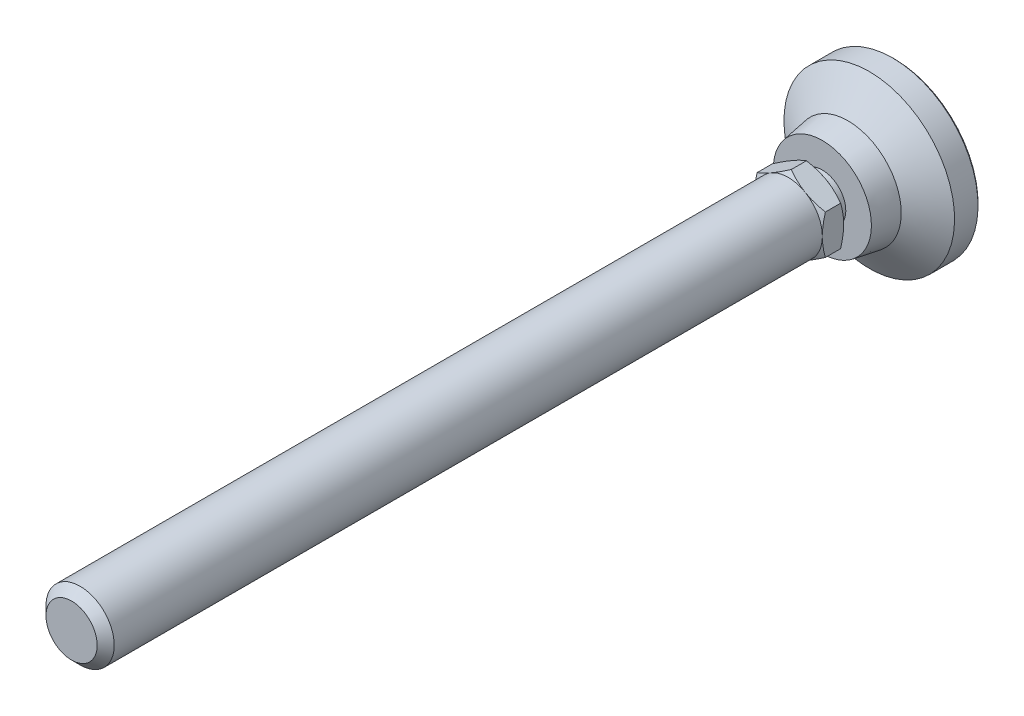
ISO-10303-21;
HEADER;
FILE_DESCRIPTION(('STEP AP214'),'2;1');
FILE_NAME('part.step','',(''),(''),'','','');
FILE_SCHEMA(('AUTOMOTIVE_DESIGN { 1 0 10303 214 1 1 1 1 }'));
ENDSEC;
DATA;
#1=APPLICATION_CONTEXT('core data for automotive mechanical design processes');
#2=APPLICATION_PROTOCOL_DEFINITION('international standard','automotive_design',2000,#1);
#3=PRODUCT_CONTEXT('',#1,'mechanical');
#4=PRODUCT('Part','Part','',(#3));
#5=PRODUCT_RELATED_PRODUCT_CATEGORY('part','',(#4));
#6=PRODUCT_DEFINITION_FORMATION('','',#4);
#7=PRODUCT_DEFINITION_CONTEXT('part definition',#1,'design');
#8=PRODUCT_DEFINITION('design','',#6,#7);
#9=PRODUCT_DEFINITION_SHAPE('','',#8);
#10=(LENGTH_UNIT() NAMED_UNIT(*) SI_UNIT(.MILLI.,.METRE.));
#11=(NAMED_UNIT(*) PLANE_ANGLE_UNIT() SI_UNIT($,.RADIAN.));
#12=(NAMED_UNIT(*) SI_UNIT($,.STERADIAN.) SOLID_ANGLE_UNIT());
#13=UNCERTAINTY_MEASURE_WITH_UNIT(LENGTH_MEASURE(1.E-05),#10,'distance_accuracy_value','');
#14=(GEOMETRIC_REPRESENTATION_CONTEXT(3) GLOBAL_UNCERTAINTY_ASSIGNED_CONTEXT((#13)) GLOBAL_UNIT_ASSIGNED_CONTEXT((#10,
#11,#12)) REPRESENTATION_CONTEXT('',''));
#15=CARTESIAN_POINT('',(0.,0.,0.));
#16=DIRECTION('',(0.,0.,1.));
#17=DIRECTION('',(1.,0.,0.));
#18=AXIS2_PLACEMENT_3D('',#15,#16,#17);
#19=CARTESIAN_POINT('',(0.,-5.50000000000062,19.9999999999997));
#20=DIRECTION('',(0.,0.,-1.));
#21=DIRECTION('',(0.,1.,0.));
#22=AXIS2_PLACEMENT_3D('',#19,#20,#21);
#23=PLANE('',#22);
#24=CARTESIAN_POINT('',(0.,0.,19.9999999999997));
#25=DIRECTION('',(0.,0.,-1.));
#26=DIRECTION('',(0.,1.,0.));
#27=AXIS2_PLACEMENT_3D('',#24,#25,#26);
#28=CIRCLE('',#27,5.50000000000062);
#29=CARTESIAN_POINT('',(0.,5.50000000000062,19.9999999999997));
#30=VERTEX_POINT('',#29);
#31=EDGE_CURVE('E289',#30,#30,#28,.T.);
#32=ORIENTED_EDGE('',*,*,#31,.F.);
#33=EDGE_LOOP('',(#32));
#34=FACE_BOUND('',#33,.T.);
#35=CARTESIAN_POINT('',(0.,0.,19.9999999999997));
#36=DIRECTION('',(0.,0.,-1.));
#37=DIRECTION('',(0.,1.,0.));
#38=AXIS2_PLACEMENT_3D('',#35,#36,#37);
#39=CIRCLE('',#38,8.00000000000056);
#40=CARTESIAN_POINT('',(-4.00000000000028,6.92820323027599,19.9999999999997));
#41=VERTEX_POINT('',#40);
#42=CARTESIAN_POINT('',(4.00000000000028,6.92820323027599,19.9999999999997));
#43=VERTEX_POINT('',#42);
#44=EDGE_CURVE('E18',#41,#43,#39,.T.);
#45=ORIENTED_EDGE('',*,*,#44,.T.);
#46=CARTESIAN_POINT('',(0.,0.,19.9999999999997));
#47=DIRECTION('',(0.,0.,-1.));
#48=DIRECTION('',(0.,1.,0.));
#49=AXIS2_PLACEMENT_3D('',#46,#47,#48);
#50=CIRCLE('',#49,8.00000000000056);
#51=CARTESIAN_POINT('',(8.00000000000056,0.,19.9999999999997));
#52=VERTEX_POINT('',#51);
#53=EDGE_CURVE('E30',#43,#52,#50,.T.);
#54=ORIENTED_EDGE('',*,*,#53,.T.);
#55=CARTESIAN_POINT('',(4.00000000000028,-6.92820323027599,19.9999999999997));
#56=VERTEX_POINT('',#55);
#57=EDGE_CURVE('E9',#52,#56,#39,.T.);
#58=ORIENTED_EDGE('',*,*,#57,.T.);
#59=CARTESIAN_POINT('',(-4.00000000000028,-6.92820323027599,19.9999999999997));
#60=VERTEX_POINT('',#59);
#61=EDGE_CURVE('E23',#56,#60,#39,.T.);
#62=ORIENTED_EDGE('',*,*,#61,.T.);
#63=CARTESIAN_POINT('',(-8.00000000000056,0.,19.9999999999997));
#64=VERTEX_POINT('',#63);
#65=EDGE_CURVE('E270',#60,#64,#39,.T.);
#66=ORIENTED_EDGE('',*,*,#65,.T.);
#67=EDGE_CURVE('E271',#64,#41,#39,.T.);
#68=ORIENTED_EDGE('',*,*,#67,.T.);
#69=EDGE_LOOP('',(#45,#54,#58,#62,#66,#68));
#70=FACE_BOUND('',#69,.T.);
#71=ADVANCED_FACE('F14',(#34,#70),#23,.T.);
#72=CARTESIAN_POINT('',(0.,0.,-1.));
#73=DIRECTION('',(0.,0.,-1.));
#74=DIRECTION('',(0.,1.,0.));
#75=AXIS2_PLACEMENT_3D('',#72,#73,#74);
#76=CYLINDRICAL_SURFACE('',#75,20.);
#77=CARTESIAN_POINT('',(0.,0.,0.500000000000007));
#78=DIRECTION('',(0.,0.,-1.));
#79=DIRECTION('',(0.,1.,0.));
#80=AXIS2_PLACEMENT_3D('',#77,#78,#79);
#81=CIRCLE('',#80,20.);
#82=CARTESIAN_POINT('',(0.,20.,0.500000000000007));
#83=VERTEX_POINT('',#82);
#84=EDGE_CURVE('E309',#83,#83,#81,.F.);
#85=ORIENTED_EDGE('',*,*,#84,.T.);
#86=EDGE_LOOP('',(#85));
#87=FACE_BOUND('',#86,.T.);
#88=CARTESIAN_POINT('',(0.,0.,6.));
#89=DIRECTION('',(0.,0.,-1.));
#90=DIRECTION('',(0.,1.,0.));
#91=AXIS2_PLACEMENT_3D('',#88,#89,#90);
#92=CIRCLE('',#91,20.);
#93=CARTESIAN_POINT('',(0.,20.,6.));
#94=VERTEX_POINT('',#93);
#95=EDGE_CURVE('E290',#94,#94,#92,.T.);
#96=ORIENTED_EDGE('',*,*,#95,.T.);
#97=EDGE_LOOP('',(#96));
#98=FACE_BOUND('',#97,.T.);
#99=ADVANCED_FACE('F332',(#87,#98),#76,.T.);
#100=CARTESIAN_POINT('',(0.,0.,-1.));
#101=DIRECTION('',(0.,0.,-1.));
#102=DIRECTION('',(0.,1.,0.));
#103=AXIS2_PLACEMENT_3D('',#100,#101,#102);
#104=CYLINDRICAL_SURFACE('',#103,5.50000000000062);
#105=CARTESIAN_POINT('',(0.,0.,17.));
#106=DIRECTION('',(0.,0.,-1.));
#107=DIRECTION('',(0.,1.,0.));
#108=AXIS2_PLACEMENT_3D('',#105,#106,#107);
#109=CIRCLE('',#108,5.50000000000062);
#110=CARTESIAN_POINT('',(0.,5.50000000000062,17.));
#111=VERTEX_POINT('',#110);
#112=EDGE_CURVE('E300',#111,#111,#109,.T.);
#113=ORIENTED_EDGE('',*,*,#112,.F.);
#114=EDGE_LOOP('',(#113));
#115=FACE_BOUND('',#114,.T.);
#116=ORIENTED_EDGE('',*,*,#31,.T.);
#117=EDGE_LOOP('',(#116));
#118=FACE_BOUND('',#117,.T.);
#119=ADVANCED_FACE('F338',(#115,#118),#104,.T.);
#120=CARTESIAN_POINT('',(-11.5,0.,17.));
#121=DIRECTION('',(0.,0.,-1.));
#122=DIRECTION('',(0.,1.,0.));
#123=AXIS2_PLACEMENT_3D('',#120,#121,#122);
#124=PLANE('',#123);
#125=CARTESIAN_POINT('',(0.,0.,17.));
#126=DIRECTION('',(0.,0.,-1.));
#127=DIRECTION('',(0.,1.,0.));
#128=AXIS2_PLACEMENT_3D('',#125,#126,#127);
#129=CIRCLE('',#128,11.5);
#130=CARTESIAN_POINT('',(0.,11.5,17.));
#131=VERTEX_POINT('',#130);
#132=EDGE_CURVE('E297',#131,#131,#129,.T.);
#133=ORIENTED_EDGE('',*,*,#132,.F.);
#134=EDGE_LOOP('',(#133));
#135=FACE_BOUND('',#134,.T.);
#136=ORIENTED_EDGE('',*,*,#112,.T.);
#137=EDGE_LOOP('',(#136));
#138=FACE_BOUND('',#137,.T.);
#139=ADVANCED_FACE('F535',(#135,#138),#124,.F.);
#140=CARTESIAN_POINT('',(0.,0.,17.));
#141=DIRECTION('',(0.,0.,-1.));
#142=DIRECTION('',(0.,1.,0.));
#143=AXIS2_PLACEMENT_3D('',#140,#141,#142);
#144=CONICAL_SURFACE('',#143,11.5,0.165148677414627);
#145=CARTESIAN_POINT('',(0.,0.,11.));
#146=DIRECTION('',(0.,0.,-1.));
#147=DIRECTION('',(0.,1.,0.));
#148=AXIS2_PLACEMENT_3D('',#145,#146,#147);
#149=CIRCLE('',#148,12.5);
#150=CARTESIAN_POINT('',(0.,12.5,11.));
#151=VERTEX_POINT('',#150);
#152=EDGE_CURVE('E293',#151,#151,#149,.T.);
#153=ORIENTED_EDGE('',*,*,#152,.F.);
#154=EDGE_LOOP('',(#153));
#155=FACE_BOUND('',#154,.T.);
#156=ORIENTED_EDGE('',*,*,#132,.T.);
#157=EDGE_LOOP('',(#156));
#158=FACE_BOUND('',#157,.T.);
#159=ADVANCED_FACE('F526',(#155,#158),#144,.T.);
#160=CARTESIAN_POINT('',(0.,0.,11.));
#161=DIRECTION('',(0.,0.,-1.));
#162=DIRECTION('',(0.,1.,0.));
#163=AXIS2_PLACEMENT_3D('',#160,#161,#162);
#164=CONICAL_SURFACE('',#163,12.5,0.982793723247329);
#165=ORIENTED_EDGE('',*,*,#95,.F.);
#166=EDGE_LOOP('',(#165));
#167=FACE_BOUND('',#166,.T.);
#168=ORIENTED_EDGE('',*,*,#152,.T.);
#169=EDGE_LOOP('',(#168));
#170=FACE_BOUND('',#169,.T.);
#171=ADVANCED_FACE('F519',(#167,#170),#164,.T.);
#172=CARTESIAN_POINT('',(0.,0.,0.));
#173=DIRECTION('',(0.,0.,-1.));
#174=DIRECTION('',(0.,1.,0.));
#175=AXIS2_PLACEMENT_3D('',#172,#173,#174);
#176=PLANE('',#175);
#177=CARTESIAN_POINT('',(0.,0.,0.));
#178=DIRECTION('',(0.,0.,-1.));
#179=DIRECTION('',(0.,1.,0.));
#180=AXIS2_PLACEMENT_3D('',#177,#178,#179);
#181=CIRCLE('',#180,19.5);
#182=CARTESIAN_POINT('',(0.,19.5,0.));
#183=VERTEX_POINT('',#182);
#184=EDGE_CURVE('E307',#183,#183,#181,.T.);
#185=ORIENTED_EDGE('',*,*,#184,.T.);
#186=EDGE_LOOP('',(#185));
#187=FACE_BOUND('',#186,.T.);
#188=ADVANCED_FACE('F235',(#187),#176,.T.);
#189=CARTESIAN_POINT('',(0.,0.,0.));
#190=DIRECTION('',(0.,0.,1.));
#191=DIRECTION('',(0.,-1.,0.));
#192=AXIS2_PLACEMENT_3D('',#189,#190,#191);
#193=CONICAL_SURFACE('',#192,19.5,0.785398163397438);
#194=ORIENTED_EDGE('',*,*,#84,.F.);
#195=EDGE_LOOP('',(#194));
#196=FACE_BOUND('',#195,.T.);
#197=ORIENTED_EDGE('',*,*,#184,.F.);
#198=EDGE_LOOP('',(#197));
#199=FACE_BOUND('',#198,.T.);
#200=ADVANCED_FACE('F16',(#196,#199),#193,.T.);
#201=CARTESIAN_POINT('',(0.,0.,19.9999999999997));
#202=DIRECTION('',(0.,0.,1.));
#203=DIRECTION('',(0.,-1.,0.));
#204=AXIS2_PLACEMENT_3D('',#201,#202,#203);
#205=CONICAL_SURFACE('',#204,8.00000000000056,1.0471975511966);
#206=ORIENTED_EDGE('',*,*,#44,.F.);
#207=CARTESIAN_POINT('',(0.000200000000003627,9.23771977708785,20.7145978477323));
#208=CARTESIAN_POINT('',(-0.175648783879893,9.13619343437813,20.6559907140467));
#209=CARTESIAN_POINT('',(-0.352153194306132,9.03428856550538,20.6000434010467));
#210=CARTESIAN_POINT('',(-0.706595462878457,8.82965122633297,20.494201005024));
#211=CARTESIAN_POINT('',(-0.884533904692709,8.72691841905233,20.4443085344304));
#212=CARTESIAN_POINT('',(-1.42119823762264,8.41707512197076,20.3046927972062));
#213=CARTESIAN_POINT('',(-1.78204258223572,8.20874154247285,20.2252811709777));
#214=CARTESIAN_POINT('',(-2.32203917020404,7.89697436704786,20.1321616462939));
#215=CARTESIAN_POINT('',(-2.49957818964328,7.79447216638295,20.1056345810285));
#216=CARTESIAN_POINT('',(-2.85545911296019,7.58900421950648,20.0611531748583));
#217=CARTESIAN_POINT('',(-3.03380094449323,7.48603851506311,20.043198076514));
#218=CARTESIAN_POINT('',(-3.39079168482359,7.27992981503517,20.0163156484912));
#219=CARTESIAN_POINT('',(-3.56944001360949,7.17678715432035,20.0073780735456));
#220=CARTESIAN_POINT('',(-3.92690170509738,6.97040655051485,19.9987223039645));
#221=CARTESIAN_POINT('',(-4.10571506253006,6.86716861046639,19.9990038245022));
#222=CARTESIAN_POINT('',(-4.4400133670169,6.67416139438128,20.0081450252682));
#223=CARTESIAN_POINT('',(-4.59552190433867,6.58437849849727,20.0158896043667));
#224=CARTESIAN_POINT('',(-4.90617476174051,6.40502298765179,20.0382011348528));
#225=CARTESIAN_POINT('',(-5.06131905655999,6.31545038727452,20.0527685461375));
#226=CARTESIAN_POINT('',(-5.52615131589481,6.04707935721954,20.1063606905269));
#227=CARTESIAN_POINT('',(-5.83501648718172,5.86875596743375,20.1552686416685));
#228=CARTESIAN_POINT('',(-6.4560232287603,5.51021755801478,20.2775394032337));
#229=CARTESIAN_POINT('',(-6.76808554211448,5.33004829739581,20.3514205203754));
#230=CARTESIAN_POINT('',(-7.38755648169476,4.97239658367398,20.5191001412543));
#231=CARTESIAN_POINT('',(-7.69497304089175,4.79490955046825,20.6128592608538));
#232=CARTESIAN_POINT('',(-8.0002,4.61868668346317,20.7145978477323));
#233=B_SPLINE_CURVE_WITH_KNOTS('',3,(#207,#208,#209,#210,#211,#212,#213,#214,#215,#216,#217,
#218,#219,#220,#221,#222,#223,#224,#225,#226,#227,#228,#229,#230,#231,#232),.UNSPECIFIED.,.F.,
.F.,(4,2,2,2,2,2,2,2,2,2,2,2,4),(0.,0.633973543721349,1.26821965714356,2.53934712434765,
3.15934343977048,3.77928496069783,4.39852133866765,5.01773858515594,5.55680239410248,
6.09590254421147,7.17487077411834,8.27776850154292,9.37850115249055),.UNSPECIFIED.);
#234=CARTESIAN_POINT('',(0.,9.23760430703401,20.7145311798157));
#235=VERTEX_POINT('',#234);
#236=EDGE_CURVE('E245',#235,#41,#233,.T.);
#237=ORIENTED_EDGE('',*,*,#236,.F.);
#238=CARTESIAN_POINT('',(8.0002,4.61868668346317,20.7145978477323));
#239=CARTESIAN_POINT('',(7.8243512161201,4.7202130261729,20.6559907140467));
#240=CARTESIAN_POINT('',(7.64784680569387,4.82211789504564,20.6000434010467));
#241=CARTESIAN_POINT('',(7.29340453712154,5.02675523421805,20.494201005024));
#242=CARTESIAN_POINT('',(7.11546609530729,5.1294880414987,20.4443085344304));
#243=CARTESIAN_POINT('',(6.57880176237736,5.43933133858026,20.3046927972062));
#244=CARTESIAN_POINT('',(6.21795741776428,5.64766491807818,20.2252811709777));
#245=CARTESIAN_POINT('',(5.67796082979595,5.95943209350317,20.1321616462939));
#246=CARTESIAN_POINT('',(5.50042181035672,6.06193429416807,20.1056345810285));
#247=CARTESIAN_POINT('',(5.1445408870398,6.26740224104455,20.0611531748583));
#248=CARTESIAN_POINT('',(4.96619905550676,6.37036794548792,20.043198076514));
#249=CARTESIAN_POINT('',(4.60920831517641,6.57647664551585,20.0163156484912));
#250=CARTESIAN_POINT('',(4.4305599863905,6.67961930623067,20.0073780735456));
#251=CARTESIAN_POINT('',(4.07309829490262,6.88599991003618,19.9987223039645));
#252=CARTESIAN_POINT('',(3.89428493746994,6.98923785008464,19.9990038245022));
#253=CARTESIAN_POINT('',(3.5599866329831,7.18224506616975,20.0081450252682));
#254=CARTESIAN_POINT('',(3.40447809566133,7.27202796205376,20.0158896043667));
#255=CARTESIAN_POINT('',(3.09382523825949,7.45138347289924,20.0382011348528));
#256=CARTESIAN_POINT('',(2.93868094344,7.54095607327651,20.0527685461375));
#257=CARTESIAN_POINT('',(2.47384868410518,7.80932710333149,20.1063606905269));
#258=CARTESIAN_POINT('',(2.16498351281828,7.98765049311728,20.1552686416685));
#259=CARTESIAN_POINT('',(1.5439767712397,8.34618890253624,20.2775394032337));
#260=CARTESIAN_POINT('',(1.23191445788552,8.52635816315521,20.3514205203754));
#261=CARTESIAN_POINT('',(0.612443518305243,8.88400987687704,20.5191001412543));
#262=CARTESIAN_POINT('',(0.305026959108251,9.06149691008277,20.6128592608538));
#263=CARTESIAN_POINT('',(-0.000199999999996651,9.23771977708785,20.7145978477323));
#264=B_SPLINE_CURVE_WITH_KNOTS('',3,(#238,#239,#240,#241,#242,#243,#244,#245,#246,#247,#248,
#249,#250,#251,#252,#253,#254,#255,#256,#257,#258,#259,#260,#261,#262,#263),.UNSPECIFIED.,.F.,
.F.,(4,2,2,2,2,2,2,2,2,2,2,2,4),(0.,0.633973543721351,1.26821965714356,2.53934712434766,
3.15934343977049,3.77928496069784,4.39852133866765,5.01773858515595,5.55680239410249,
6.09590254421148,7.17487077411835,8.27776850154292,9.37850115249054),.UNSPECIFIED.);
#265=EDGE_CURVE('E244',#43,#235,#264,.T.);
#266=ORIENTED_EDGE('',*,*,#265,.F.);
#267=EDGE_LOOP('',(#206,#237,#266));
#268=FACE_BOUND('',#267,.T.);
#269=ADVANCED_FACE('F321',(#268),#205,.T.);
#270=CARTESIAN_POINT('',(-8.,4.61880215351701,20.7145311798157));
#271=VERTEX_POINT('',#270);
#272=EDGE_CURVE('E126',#41,#271,#233,.T.);
#273=ORIENTED_EDGE('',*,*,#272,.F.);
#274=ORIENTED_EDGE('',*,*,#67,.F.);
#275=CARTESIAN_POINT('',(-8.,12.3218577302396,23.8631036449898));
#276=CARTESIAN_POINT('',(-8.,11.9731509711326,23.6942924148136));
#277=CARTESIAN_POINT('',(-8.,11.6236345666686,23.5271245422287));
#278=CARTESIAN_POINT('',(-8.,10.922551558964,23.1970015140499));
#279=CARTESIAN_POINT('',(-8.,10.5709846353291,23.0340470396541));
#280=CARTESIAN_POINT('',(-8.,9.86351720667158,22.7124387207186));
#281=CARTESIAN_POINT('',(-8.,9.50760347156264,22.5538138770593));
#282=CARTESIAN_POINT('',(-8.,8.79291541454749,22.2431699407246));
#283=CARTESIAN_POINT('',(-8.,8.43414123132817,22.0911505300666));
#284=CARTESIAN_POINT('',(-8.,7.70190541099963,21.7908480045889));
#285=CARTESIAN_POINT('',(-8.,7.32833470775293,21.6428293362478));
#286=CARTESIAN_POINT('',(-8.,6.57679243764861,21.3582013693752));
#287=CARTESIAN_POINT('',(-8.,6.19882037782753,21.2215933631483));
#288=CARTESIAN_POINT('',(-8.,5.43860485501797,20.9634357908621));
#289=CARTESIAN_POINT('',(-8.,5.05637211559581,20.8418549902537));
#290=CARTESIAN_POINT('',(-8.,4.2864387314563,20.6177072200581));
#291=CARTESIAN_POINT('',(-8.,3.89873987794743,20.5151341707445));
#292=CARTESIAN_POINT('',(-8.,3.11972852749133,20.3345289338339));
#293=CARTESIAN_POINT('',(-8.,2.72844703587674,20.2563666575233));
#294=CARTESIAN_POINT('',(-8.,2.13803049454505,20.1608562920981));
#295=CARTESIAN_POINT('',(-8.,1.94062740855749,20.1326403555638));
#296=CARTESIAN_POINT('',(-8.,1.54486916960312,20.0840081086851));
#297=CARTESIAN_POINT('',(-8.,1.34651411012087,20.0635910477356));
#298=CARTESIAN_POINT('',(-8.,0.951671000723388,20.0312149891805));
#299=CARTESIAN_POINT('',(-8.,0.755191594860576,20.0191509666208));
#300=CARTESIAN_POINT('',(-8.,0.361899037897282,20.003336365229));
#301=CARTESIAN_POINT('',(-8.,0.165085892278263,19.9995856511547));
#302=CARTESIAN_POINT('',(-8.,-0.228523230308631,20.0004869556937));
#303=CARTESIAN_POINT('',(-8.,-0.425319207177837,20.0051390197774));
#304=CARTESIAN_POINT('',(-8.,-0.818542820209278,20.022733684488));
#305=CARTESIAN_POINT('',(-8.,-1.014970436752,20.0356767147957));
#306=CARTESIAN_POINT('',(-8.,-1.48965866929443,20.0767021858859));
#307=CARTESIAN_POINT('',(-8.,-1.76757394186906,20.1088633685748));
#308=CARTESIAN_POINT('',(-8.,-2.32127244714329,20.1880077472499));
#309=CARTESIAN_POINT('',(-8.,-2.59705537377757,20.2349930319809));
#310=CARTESIAN_POINT('',(-8.,-3.42093009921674,20.3956875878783));
#311=CARTESIAN_POINT('',(-8.,-3.96522505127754,20.5291040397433));
#312=CARTESIAN_POINT('',(-8.,-4.77895956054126,20.7595783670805));
#313=CARTESIAN_POINT('',(-8.,-5.05264213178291,20.8425096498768));
#314=CARTESIAN_POINT('',(-8.,-5.5973478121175,21.0167667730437));
#315=CARTESIAN_POINT('',(-8.,-5.86837090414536,21.1080926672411));
#316=CARTESIAN_POINT('',(-8.,-6.40784695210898,21.297692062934));
#317=CARTESIAN_POINT('',(-8.,-6.67630077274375,21.3959631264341));
#318=CARTESIAN_POINT('',(-8.,-7.21099929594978,21.5983185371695));
#319=CARTESIAN_POINT('',(-8.,-7.47724401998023,21.7024028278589));
#320=CARTESIAN_POINT('',(-8.,-8.08663915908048,21.9470822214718));
#321=CARTESIAN_POINT('',(-8.,-8.42912340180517,22.0893330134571));
#322=CARTESIAN_POINT('',(-8.,-9.11132899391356,22.3803292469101));
#323=CARTESIAN_POINT('',(-8.,-9.45105020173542,22.529075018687));
#324=CARTESIAN_POINT('',(-8.,-10.1282199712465,22.8318116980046));
#325=CARTESIAN_POINT('',(-8.,-10.4656680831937,22.9858036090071));
#326=CARTESIAN_POINT('',(-8.,-11.1385903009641,23.2980179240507));
#327=CARTESIAN_POINT('',(-8.,-11.4740644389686,23.4562402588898));
#328=CARTESIAN_POINT('',(-8.,-12.1436574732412,23.7762979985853));
#329=CARTESIAN_POINT('',(-8.,-12.4777748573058,23.9381365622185));
#330=CARTESIAN_POINT('',(-8.,-13.1446010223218,24.2646924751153));
#331=CARTESIAN_POINT('',(-8.,-13.4773097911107,24.4294098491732));
#332=CARTESIAN_POINT('',(-8.,-14.4736624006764,24.9271480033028));
#333=CARTESIAN_POINT('',(-8.,-15.1355189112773,25.2637482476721));
#334=CARTESIAN_POINT('',(-8.,-16.0995120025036,25.7602747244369));
#335=CARTESIAN_POINT('',(-8.,-16.4030361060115,25.9175239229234));
#336=CARTESIAN_POINT('',(-8.,-17.0094220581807,26.2332826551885));
#337=CARTESIAN_POINT('',(-8.,-17.3122839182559,26.3917921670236));
#338=CARTESIAN_POINT('',(-8.,-18.2200305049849,26.868971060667));
#339=CARTESIAN_POINT('',(-8.,-18.8240537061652,27.1892791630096));
#340=CARTESIAN_POINT('',(-8.,-20.0289393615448,27.8325138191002));
#341=CARTESIAN_POINT('',(-8.,-20.6298058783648,28.1554327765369));
#342=CARTESIAN_POINT('',(-8.,-21.8300709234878,28.8039165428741));
#343=CARTESIAN_POINT('',(-8.,-22.429469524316,29.1294812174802));
#344=CARTESIAN_POINT('',(-8.,-23.0283220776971,29.4560408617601));
#345=B_SPLINE_CURVE_WITH_KNOTS('',3,(#275,#276,#277,#278,#279,#280,#281,#282,#283,#284,#285,
#286,#287,#288,#289,#290,#291,#292,#293,#294,#295,#296,#297,#298,#299,#300,#301,#302,#303,#304,
#305,#306,#307,#308,#309,#310,#311,#312,#313,#314,#315,#316,#317,#318,#319,#320,#321,#322,#323,
#324,#325,#326,#327,#328,#329,#330,#331,#332,#333,#334,#335,#336,#337,#338,#339,#340,#341,#342,
#343,#344),.UNSPECIFIED.,.F.,.F.,(4,2,2,2,2,2,2,2,2,2,2,2,2,2,2,2,2,2,2,2,2,2,2,2,2,2,2,2,2,2,2,
2,2,2,4),(0.,1.16227220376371,2.32473115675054,3.49366324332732,4.66253899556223,
5.86787414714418,7.07334562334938,8.27626777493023,9.47880449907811,10.6748188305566,
11.2729172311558,11.8709580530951,12.4613358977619,13.0517041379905,13.64207557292,
14.23247760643,15.071311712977,15.9102640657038,17.5891374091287,18.4469835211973,
19.3048351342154,20.1623870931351,21.0199307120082,22.1323966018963,23.2449191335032,
24.3576556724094,25.4703740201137,26.5841055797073,27.6978467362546,29.9253744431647,
30.9508917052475,31.9763911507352,34.0274661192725,36.0738841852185,38.1201990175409),.UNSPECIFIED.);
#346=EDGE_CURVE('E38',#271,#64,#345,.T.);
#347=ORIENTED_EDGE('',*,*,#346,.F.);
#348=EDGE_LOOP('',(#273,#274,#347));
#349=FACE_BOUND('',#348,.T.);
#350=ADVANCED_FACE('F155',(#349),#205,.T.);
#351=CARTESIAN_POINT('',(-8.,-4.618802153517,20.7145311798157));
#352=VERTEX_POINT('',#351);
#353=EDGE_CURVE('E246',#64,#352,#345,.T.);
#354=ORIENTED_EDGE('',*,*,#353,.F.);
#355=ORIENTED_EDGE('',*,*,#65,.F.);
#356=CARTESIAN_POINT('',(-8.0002,-4.61868668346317,20.7145978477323));
#357=CARTESIAN_POINT('',(-7.8243512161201,-4.72021302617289,20.6559907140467));
#358=CARTESIAN_POINT('',(-7.64784680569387,-4.82211789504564,20.6000434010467));
#359=CARTESIAN_POINT('',(-7.29340453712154,-5.02675523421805,20.494201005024));
#360=CARTESIAN_POINT('',(-7.11546609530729,-5.12948804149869,20.4443085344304));
#361=CARTESIAN_POINT('',(-6.57880176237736,-5.43933133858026,20.3046927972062));
#362=CARTESIAN_POINT('',(-6.21795741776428,-5.64766491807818,20.2252811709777));
#363=CARTESIAN_POINT('',(-5.67796082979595,-5.95943209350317,20.1321616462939));
#364=CARTESIAN_POINT('',(-5.50042181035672,-6.06193429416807,20.1056345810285));
#365=CARTESIAN_POINT('',(-5.1445408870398,-6.26740224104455,20.0611531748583));
#366=CARTESIAN_POINT('',(-4.96619905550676,-6.37036794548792,20.043198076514));
#367=CARTESIAN_POINT('',(-4.60920831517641,-6.57647664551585,20.0163156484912));
#368=CARTESIAN_POINT('',(-4.4305599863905,-6.67961930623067,20.0073780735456));
#369=CARTESIAN_POINT('',(-4.07309829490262,-6.88599991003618,19.9987223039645));
#370=CARTESIAN_POINT('',(-3.89428493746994,-6.98923785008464,19.9990038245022));
#371=CARTESIAN_POINT('',(-3.5599866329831,-7.18224506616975,20.0081450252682));
#372=CARTESIAN_POINT('',(-3.40447809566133,-7.27202796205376,20.0158896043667));
#373=CARTESIAN_POINT('',(-3.09382523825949,-7.45138347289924,20.0382011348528));
#374=CARTESIAN_POINT('',(-2.93868094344,-7.5409560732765,20.0527685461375));
#375=CARTESIAN_POINT('',(-2.47384868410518,-7.80932710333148,20.1063606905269));
#376=CARTESIAN_POINT('',(-2.16498351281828,-7.98765049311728,20.1552686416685));
#377=CARTESIAN_POINT('',(-1.5439767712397,-8.34618890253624,20.2775394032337));
#378=CARTESIAN_POINT('',(-1.23191445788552,-8.52635816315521,20.3514205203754));
#379=CARTESIAN_POINT('',(-0.612443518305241,-8.88400987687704,20.5191001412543));
#380=CARTESIAN_POINT('',(-0.305026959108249,-9.06149691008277,20.6128592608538));
#381=CARTESIAN_POINT('',(0.000200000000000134,-9.23771977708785,20.7145978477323));
#382=B_SPLINE_CURVE_WITH_KNOTS('',3,(#356,#357,#358,#359,#360,#361,#362,#363,#364,#365,#366,
#367,#368,#369,#370,#371,#372,#373,#374,#375,#376,#377,#378,#379,#380,#381),.UNSPECIFIED.,.F.,
.F.,(4,2,2,2,2,2,2,2,2,2,2,2,4),(0.,0.63397354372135,1.26821965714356,2.53934712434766,
3.15934343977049,3.77928496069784,4.39852133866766,5.01773858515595,5.55680239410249,
6.09590254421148,7.17487077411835,8.27776850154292,9.37850115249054),.UNSPECIFIED.);
#383=EDGE_CURVE('E113',#352,#60,#382,.T.);
#384=ORIENTED_EDGE('',*,*,#383,.F.);
#385=EDGE_LOOP('',(#354,#355,#384));
#386=FACE_BOUND('',#385,.T.);
#387=ADVANCED_FACE('F268',(#386),#205,.T.);
#388=CARTESIAN_POINT('',(0.,-9.23760430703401,20.7145311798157));
#389=VERTEX_POINT('',#388);
#390=EDGE_CURVE('E133',#60,#389,#382,.T.);
#391=ORIENTED_EDGE('',*,*,#390,.F.);
#392=ORIENTED_EDGE('',*,*,#61,.F.);
#393=CARTESIAN_POINT('',(-0.0002,-9.23771977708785,20.7145978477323));
#394=CARTESIAN_POINT('',(0.175648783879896,-9.13619343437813,20.6559907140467));
#395=CARTESIAN_POINT('',(0.352153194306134,-9.03428856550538,20.6000434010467));
#396=CARTESIAN_POINT('',(0.706595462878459,-8.82965122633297,20.494201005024));
#397=CARTESIAN_POINT('',(0.884533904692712,-8.72691841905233,20.4443085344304));
#398=CARTESIAN_POINT('',(1.42119823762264,-8.41707512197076,20.3046927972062));
#399=CARTESIAN_POINT('',(1.78204258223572,-8.20874154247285,20.2252811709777));
#400=CARTESIAN_POINT('',(2.32203917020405,-7.89697436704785,20.1321616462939));
#401=CARTESIAN_POINT('',(2.49957818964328,-7.79447216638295,20.1056345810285));
#402=CARTESIAN_POINT('',(2.8554591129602,-7.58900421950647,20.0611531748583));
#403=CARTESIAN_POINT('',(3.03380094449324,-7.4860385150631,20.043198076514));
#404=CARTESIAN_POINT('',(3.39079168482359,-7.27992981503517,20.0163156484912));
#405=CARTESIAN_POINT('',(3.5694400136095,-7.17678715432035,20.0073780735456));
#406=CARTESIAN_POINT('',(3.92690170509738,-6.97040655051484,19.9987223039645));
#407=CARTESIAN_POINT('',(4.10571506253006,-6.86716861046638,19.9990038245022));
#408=CARTESIAN_POINT('',(4.4400133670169,-6.67416139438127,20.0081450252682));
#409=CARTESIAN_POINT('',(4.59552190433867,-6.58437849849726,20.0158896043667));
#410=CARTESIAN_POINT('',(4.90617476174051,-6.40502298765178,20.0382011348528));
#411=CARTESIAN_POINT('',(5.06131905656,-6.31545038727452,20.0527685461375));
#412=CARTESIAN_POINT('',(5.52615131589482,-6.04707935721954,20.1063606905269));
#413=CARTESIAN_POINT('',(5.83501648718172,-5.86875596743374,20.1552686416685));
#414=CARTESIAN_POINT('',(6.4560232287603,-5.51021755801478,20.2775394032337));
#415=CARTESIAN_POINT('',(6.76808554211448,-5.33004829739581,20.3514205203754));
#416=CARTESIAN_POINT('',(7.38755648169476,-4.97239658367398,20.5191001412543));
#417=CARTESIAN_POINT('',(7.69497304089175,-4.79490955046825,20.6128592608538));
#418=CARTESIAN_POINT('',(8.0002,-4.61868668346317,20.7145978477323));
#419=B_SPLINE_CURVE_WITH_KNOTS('',3,(#393,#394,#395,#396,#397,#398,#399,#400,#401,#402,#403,
#404,#405,#406,#407,#408,#409,#410,#411,#412,#413,#414,#415,#416,#417,#418),.UNSPECIFIED.,.F.,
.F.,(4,2,2,2,2,2,2,2,2,2,2,2,4),(0.,0.633973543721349,1.26821965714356,2.53934712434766,
3.15934343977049,3.77928496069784,4.39852133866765,5.01773858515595,5.55680239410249,
6.09590254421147,7.17487077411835,8.27776850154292,9.37850115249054),.UNSPECIFIED.);
#420=EDGE_CURVE('E274',#389,#56,#419,.T.);
#421=ORIENTED_EDGE('',*,*,#420,.F.);
#422=EDGE_LOOP('',(#391,#392,#421));
#423=FACE_BOUND('',#422,.T.);
#424=ADVANCED_FACE('F273',(#423),#205,.T.);
#425=ORIENTED_EDGE('',*,*,#57,.F.);
#426=CARTESIAN_POINT('',(8.,12.3218577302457,23.8631036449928));
#427=CARTESIAN_POINT('',(8.,11.9731509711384,23.6942924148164));
#428=CARTESIAN_POINT('',(8.,11.6236345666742,23.5271245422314));
#429=CARTESIAN_POINT('',(8.,10.9225515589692,23.1970015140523));
#430=CARTESIAN_POINT('',(8.,10.5709846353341,23.0340470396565));
#431=CARTESIAN_POINT('',(8.,9.86351720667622,22.7124387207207));
#432=CARTESIAN_POINT('',(8.,9.50760347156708,22.5538138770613));
#433=CARTESIAN_POINT('',(8.,8.79291541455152,22.2431699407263));
#434=CARTESIAN_POINT('',(8.,8.43414123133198,22.0911505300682));
#435=CARTESIAN_POINT('',(8.,7.70190541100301,21.7908480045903));
#436=CARTESIAN_POINT('',(8.,7.32833470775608,21.642829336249));
#437=CARTESIAN_POINT('',(8.,6.57679243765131,21.3582013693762));
#438=CARTESIAN_POINT('',(8.,6.19882037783,21.2215933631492));
#439=CARTESIAN_POINT('',(8.,5.43860485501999,20.9634357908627));
#440=CARTESIAN_POINT('',(8.,5.05637211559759,20.8418549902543));
#441=CARTESIAN_POINT('',(8.,4.28643873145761,20.6177072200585));
#442=CARTESIAN_POINT('',(8.,3.8987398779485,20.5151341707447));
#443=CARTESIAN_POINT('',(8.,3.11972852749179,20.334528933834));
#444=CARTESIAN_POINT('',(8.,2.72844703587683,20.2563666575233));
#445=CARTESIAN_POINT('',(8.,2.13803049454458,20.160856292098));
#446=CARTESIAN_POINT('',(8.,1.94062740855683,20.1326403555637));
#447=CARTESIAN_POINT('',(8.,1.54486916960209,20.0840081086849));
#448=CARTESIAN_POINT('',(8.,1.34651411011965,20.0635910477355));
#449=CARTESIAN_POINT('',(8.,0.951671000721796,20.0312149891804));
#450=CARTESIAN_POINT('',(8.,0.7551915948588,20.0191509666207));
#451=CARTESIAN_POINT('',(8.,0.361899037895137,20.003336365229));
#452=CARTESIAN_POINT('',(8.,0.165085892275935,19.9995856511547));
#453=CARTESIAN_POINT('',(8.,-0.228523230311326,20.0004869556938));
#454=CARTESIAN_POINT('',(8.,-0.425319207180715,20.0051390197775));
#455=CARTESIAN_POINT('',(8.,-0.81854282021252,20.0227336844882));
#456=CARTESIAN_POINT('',(8.,-1.01497043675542,20.0356767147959));
#457=CARTESIAN_POINT('',(8.,-1.48965866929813,20.0767021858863));
#458=CARTESIAN_POINT('',(8.,-1.76757394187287,20.1088633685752));
#459=CARTESIAN_POINT('',(8.,-2.32127244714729,20.1880077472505));
#460=CARTESIAN_POINT('',(8.,-2.59705537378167,20.2349930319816));
#461=CARTESIAN_POINT('',(8.,-3.42093009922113,20.3956875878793));
#462=CARTESIAN_POINT('',(8.,-3.96522505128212,20.5291040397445));
#463=CARTESIAN_POINT('',(8.,-4.77895956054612,20.7595783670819));
#464=CARTESIAN_POINT('',(8.,-5.05264213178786,20.8425096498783));
#465=CARTESIAN_POINT('',(8.,-5.59734781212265,21.0167667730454));
#466=CARTESIAN_POINT('',(8.,-5.8683709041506,21.1080926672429));
#467=CARTESIAN_POINT('',(8.,-6.40784695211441,21.297692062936));
#468=CARTESIAN_POINT('',(8.,-6.67630077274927,21.3959631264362));
#469=CARTESIAN_POINT('',(8.,-7.21099929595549,21.5983185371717));
#470=CARTESIAN_POINT('',(8.,-7.47724401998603,21.7024028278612));
#471=CARTESIAN_POINT('',(8.,-8.08663915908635,21.9470822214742));
#472=CARTESIAN_POINT('',(8.,-8.42912340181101,22.0893330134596));
#473=CARTESIAN_POINT('',(8.,-9.11132899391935,22.3803292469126));
#474=CARTESIAN_POINT('',(8.,-9.45105020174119,22.5290750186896));
#475=CARTESIAN_POINT('',(8.,-10.1282199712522,22.8318116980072));
#476=CARTESIAN_POINT('',(8.,-10.4656680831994,22.9858036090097));
#477=CARTESIAN_POINT('',(8.,-11.1385903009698,23.2980179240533));
#478=CARTESIAN_POINT('',(8.,-11.4740644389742,23.4562402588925));
#479=CARTESIAN_POINT('',(8.,-12.1436574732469,23.776297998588));
#480=CARTESIAN_POINT('',(8.,-12.4777748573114,23.9381365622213));
#481=CARTESIAN_POINT('',(8.,-13.1446010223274,24.2646924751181));
#482=CARTESIAN_POINT('',(8.,-13.4773097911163,24.429409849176));
#483=CARTESIAN_POINT('',(8.,-14.473662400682,24.9271480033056));
#484=CARTESIAN_POINT('',(8.,-15.1355189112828,25.2637482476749));
#485=CARTESIAN_POINT('',(8.,-16.0995120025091,25.7602747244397));
#486=CARTESIAN_POINT('',(8.,-16.403036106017,25.9175239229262));
#487=CARTESIAN_POINT('',(8.,-17.0094220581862,26.2332826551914));
#488=CARTESIAN_POINT('',(8.,-17.3122839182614,26.3917921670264));
#489=CARTESIAN_POINT('',(8.,-18.2200305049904,26.8689710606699));
#490=CARTESIAN_POINT('',(7.99999999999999,-18.8240537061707,27.1892791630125));
#491=CARTESIAN_POINT('',(7.99999999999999,-20.0289393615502,27.8325138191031));
#492=CARTESIAN_POINT('',(7.99999999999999,-20.6298058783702,28.1554327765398));
#493=CARTESIAN_POINT('',(7.99999999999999,-21.8300709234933,28.8039165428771));
#494=CARTESIAN_POINT('',(8.,-22.4294695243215,29.1294812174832));
#495=CARTESIAN_POINT('',(8.,-23.0283220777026,29.4560408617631));
#496=B_SPLINE_CURVE_WITH_KNOTS('',3,(#426,#427,#428,#429,#430,#431,#432,#433,#434,#435,#436,
#437,#438,#439,#440,#441,#442,#443,#444,#445,#446,#447,#448,#449,#450,#451,#452,#453,#454,#455,
#456,#457,#458,#459,#460,#461,#462,#463,#464,#465,#466,#467,#468,#469,#470,#471,#472,#473,#474,
#475,#476,#477,#478,#479,#480,#481,#482,#483,#484,#485,#486,#487,#488,#489,#490,#491,#492,#493,
#494,#495),.UNSPECIFIED.,.F.,.F.,(4,2,2,2,2,2,2,2,2,2,2,2,2,2,2,2,2,2,2,2,2,2,2,2,2,2,2,2,2,2,2,
2,2,2,4),(0.,1.16227220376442,2.32473115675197,3.49366324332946,4.66253899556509,
5.8678741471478,7.07334562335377,8.27626777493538,9.47880449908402,10.6748188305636,
11.2729172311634,11.8709580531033,12.4613358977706,13.0517041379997,13.6420755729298,
14.2324776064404,15.0713117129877,15.9102640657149,17.5891374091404,18.4469835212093,
19.3048351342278,20.1623870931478,21.0199307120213,22.1323966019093,23.2449191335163,
24.3576556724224,25.4703740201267,26.5841055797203,27.6978467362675,29.9253744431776,
30.9508917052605,31.9763911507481,34.0274661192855,36.0738841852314,38.1201990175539),.UNSPECIFIED.);
#497=CARTESIAN_POINT('',(8.,-4.61880215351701,20.7145311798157));
#498=VERTEX_POINT('',#497);
#499=EDGE_CURVE('E112',#498,#52,#496,.F.);
#500=ORIENTED_EDGE('',*,*,#499,.F.);
#501=EDGE_CURVE('E118',#56,#498,#419,.T.);
#502=ORIENTED_EDGE('',*,*,#501,.F.);
#503=EDGE_LOOP('',(#425,#500,#502));
#504=FACE_BOUND('',#503,.T.);
#505=ADVANCED_FACE('F116',(#504),#205,.T.);
#506=ORIENTED_EDGE('',*,*,#53,.F.);
#507=CARTESIAN_POINT('',(8.,4.61880215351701,20.7145311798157));
#508=VERTEX_POINT('',#507);
#509=EDGE_CURVE('E107',#508,#43,#264,.T.);
#510=ORIENTED_EDGE('',*,*,#509,.F.);
#511=EDGE_CURVE('E103',#52,#508,#496,.F.);
#512=ORIENTED_EDGE('',*,*,#511,.F.);
#513=EDGE_LOOP('',(#506,#510,#512));
#514=FACE_BOUND('',#513,.T.);
#515=ADVANCED_FACE('F105',(#514),#205,.T.);
#516=CARTESIAN_POINT('',(0.,0.,193.));
#517=DIRECTION('',(0.,0.,-1.));
#518=DIRECTION('',(0.,1.,0.));
#519=AXIS2_PLACEMENT_3D('',#516,#517,#518);
#520=PLANE('',#519);
#521=CARTESIAN_POINT('',(0.,0.,193.));
#522=DIRECTION('',(0.,0.,-1.));
#523=DIRECTION('',(0.,1.,0.));
#524=AXIS2_PLACEMENT_3D('',#521,#522,#523);
#525=CIRCLE('',#524,6.00000000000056);
#526=CARTESIAN_POINT('',(0.,6.00000000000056,193.));
#527=VERTEX_POINT('',#526);
#528=EDGE_CURVE('E353',#527,#527,#525,.T.);
#529=ORIENTED_EDGE('',*,*,#528,.F.);
#530=EDGE_LOOP('',(#529));
#531=FACE_BOUND('',#530,.T.);
#532=ADVANCED_FACE('F341',(#531),#520,.F.);
#533=CARTESIAN_POINT('',(0.,0.,193.));
#534=DIRECTION('',(0.,0.,-1.));
#535=DIRECTION('',(0.,1.,0.));
#536=AXIS2_PLACEMENT_3D('',#533,#534,#535);
#537=CONICAL_SURFACE('',#536,6.00000000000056,0.785398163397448);
#538=CARTESIAN_POINT('',(0.,0.,191.));
#539=DIRECTION('',(0.,0.,-1.));
#540=DIRECTION('',(0.,1.,0.));
#541=AXIS2_PLACEMENT_3D('',#538,#539,#540);
#542=CIRCLE('',#541,8.00000000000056);
#543=CARTESIAN_POINT('',(0.,8.00000000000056,191.));
#544=VERTEX_POINT('',#543);
#545=EDGE_CURVE('E355',#544,#544,#542,.T.);
#546=ORIENTED_EDGE('',*,*,#545,.F.);
#547=EDGE_LOOP('',(#546));
#548=FACE_BOUND('',#547,.T.);
#549=ORIENTED_EDGE('',*,*,#528,.T.);
#550=EDGE_LOOP('',(#549));
#551=FACE_BOUND('',#550,.T.);
#552=ADVANCED_FACE('F197',(#548,#551),#537,.T.);
#553=CARTESIAN_POINT('',(0.,0.,-1.));
#554=DIRECTION('',(0.,0.,-1.));
#555=DIRECTION('',(0.,1.,0.));
#556=AXIS2_PLACEMENT_3D('',#553,#554,#555);
#557=CYLINDRICAL_SURFACE('',#556,8.00000000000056);
#558=CARTESIAN_POINT('',(0.,0.,25.));
#559=DIRECTION('',(0.,0.,-1.));
#560=DIRECTION('',(0.,1.,0.));
#561=AXIS2_PLACEMENT_3D('',#558,#559,#560);
#562=CIRCLE('',#561,8.00000000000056);
#563=CARTESIAN_POINT('',(4.,6.92820323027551,25.));
#564=VERTEX_POINT('',#563);
#565=CARTESIAN_POINT('',(8.,0.,25.));
#566=VERTEX_POINT('',#565);
#567=EDGE_CURVE('E276',#564,#566,#562,.T.);
#568=ORIENTED_EDGE('',*,*,#567,.F.);
#569=CARTESIAN_POINT('',(0.,0.,25.));
#570=DIRECTION('',(0.,0.,-1.));
#571=DIRECTION('',(0.,1.,0.));
#572=AXIS2_PLACEMENT_3D('',#569,#570,#571);
#573=CIRCLE('',#572,8.00000000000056);
#574=CARTESIAN_POINT('',(-4.,6.92820323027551,25.));
#575=VERTEX_POINT('',#574);
#576=EDGE_CURVE('E303',#575,#564,#573,.T.);
#577=ORIENTED_EDGE('',*,*,#576,.F.);
#578=CARTESIAN_POINT('',(-8.,0.,25.));
#579=VERTEX_POINT('',#578);
#580=EDGE_CURVE('E305',#579,#575,#573,.T.);
#581=ORIENTED_EDGE('',*,*,#580,.F.);
#582=CARTESIAN_POINT('',(-4.,-6.92820323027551,25.));
#583=VERTEX_POINT('',#582);
#584=EDGE_CURVE('E370',#583,#579,#573,.T.);
#585=ORIENTED_EDGE('',*,*,#584,.F.);
#586=CARTESIAN_POINT('',(4.,-6.92820323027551,25.));
#587=VERTEX_POINT('',#586);
#588=EDGE_CURVE('E601',#587,#583,#573,.T.);
#589=ORIENTED_EDGE('',*,*,#588,.F.);
#590=EDGE_CURVE('E306',#566,#587,#573,.T.);
#591=ORIENTED_EDGE('',*,*,#590,.F.);
#592=EDGE_LOOP('',(#568,#577,#581,#585,#589,#591));
#593=FACE_BOUND('',#592,.T.);
#594=ORIENTED_EDGE('',*,*,#545,.T.);
#595=EDGE_LOOP('',(#594));
#596=FACE_BOUND('',#595,.T.);
#597=ADVANCED_FACE('F349',(#593,#596),#557,.T.);
#598=CARTESIAN_POINT('',(0.,0.,23.7666066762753));
#599=DIRECTION('',(0.,0.,-1.));
#600=DIRECTION('',(0.,1.,0.));
#601=AXIS2_PLACEMENT_3D('',#598,#599,#600);
#602=CONICAL_SURFACE('',#601,10.136299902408,1.0471975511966);
#603=ORIENTED_EDGE('',*,*,#567,.T.);
#604=CARTESIAN_POINT('',(8.,12.3218577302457,21.136896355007));
#605=CARTESIAN_POINT('',(8.,11.9731509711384,21.3057075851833));
#606=CARTESIAN_POINT('',(8.,11.6236345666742,21.4728754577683));
#607=CARTESIAN_POINT('',(8.,10.9225515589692,21.8029984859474));
#608=CARTESIAN_POINT('',(8.,10.5709846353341,21.9659529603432));
#609=CARTESIAN_POINT('',(8.,9.86351720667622,22.287561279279));
#610=CARTESIAN_POINT('',(8.,9.50760347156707,22.4461861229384));
#611=CARTESIAN_POINT('',(8.,8.79291541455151,22.7568300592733));
#612=CARTESIAN_POINT('',(8.,8.43414123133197,22.9088494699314));
#613=CARTESIAN_POINT('',(8.,7.701905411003,23.2091519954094));
#614=CARTESIAN_POINT('',(8.,7.32833470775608,23.3571706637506));
#615=CARTESIAN_POINT('',(8.,6.57679243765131,23.6417986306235));
#616=CARTESIAN_POINT('',(8.,6.19882037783,23.7784066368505));
#617=CARTESIAN_POINT('',(8.,5.43860485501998,24.036564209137));
#618=CARTESIAN_POINT('',(8.,5.05637211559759,24.1581450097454));
#619=CARTESIAN_POINT('',(8.,4.2864387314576,24.3822927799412));
#620=CARTESIAN_POINT('',(8.,3.89873987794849,24.484865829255));
#621=CARTESIAN_POINT('',(8.,3.11972852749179,24.6654710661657));
#622=CARTESIAN_POINT('',(8.,2.72844703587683,24.7436333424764));
#623=CARTESIAN_POINT('',(8.,2.13803049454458,24.8391437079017));
#624=CARTESIAN_POINT('',(8.,1.94062740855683,24.867359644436));
#625=CARTESIAN_POINT('',(8.,1.54486916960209,24.9159918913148));
#626=CARTESIAN_POINT('',(8.,1.34651411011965,24.9364089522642));
#627=CARTESIAN_POINT('',(8.,0.951671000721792,24.9687850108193));
#628=CARTESIAN_POINT('',(8.,0.755191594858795,24.980849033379));
#629=CARTESIAN_POINT('',(8.,0.361899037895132,24.9966636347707));
#630=CARTESIAN_POINT('',(8.,0.16508589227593,25.000414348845));
#631=CARTESIAN_POINT('',(8.,-0.22852323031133,24.9995130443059));
#632=CARTESIAN_POINT('',(8.,-0.425319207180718,24.9948609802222));
#633=CARTESIAN_POINT('',(8.,-0.818542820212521,24.9772663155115));
#634=CARTESIAN_POINT('',(8.,-1.01497043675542,24.9643232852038));
#635=CARTESIAN_POINT('',(8.,-1.48965866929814,24.9232978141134));
#636=CARTESIAN_POINT('',(8.,-1.76757394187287,24.8911366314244));
#637=CARTESIAN_POINT('',(8.,-2.32127244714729,24.8119922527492));
#638=CARTESIAN_POINT('',(8.,-2.59705537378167,24.7650069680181));
#639=CARTESIAN_POINT('',(8.,-3.42093009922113,24.6043124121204));
#640=CARTESIAN_POINT('',(8.,-3.96522505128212,24.4708959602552));
#641=CARTESIAN_POINT('',(8.,-4.77895956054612,24.2404216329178));
#642=CARTESIAN_POINT('',(8.,-5.05264213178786,24.1574903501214));
#643=CARTESIAN_POINT('',(8.,-5.59734781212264,23.9832332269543));
#644=CARTESIAN_POINT('',(8.,-5.86837090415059,23.8919073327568));
#645=CARTESIAN_POINT('',(8.,-6.4078469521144,23.7023079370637));
#646=CARTESIAN_POINT('',(8.,-6.67630077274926,23.6040368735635));
#647=CARTESIAN_POINT('',(8.,-7.21099929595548,23.401681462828));
#648=CARTESIAN_POINT('',(8.,-7.47724401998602,23.2975971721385));
#649=CARTESIAN_POINT('',(8.,-8.08663915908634,23.0529177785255));
#650=CARTESIAN_POINT('',(8.,-8.42912340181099,22.9106669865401));
#651=CARTESIAN_POINT('',(8.,-9.11132899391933,22.6196707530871));
#652=CARTESIAN_POINT('',(8.,-9.45105020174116,22.4709249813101));
#653=CARTESIAN_POINT('',(8.,-10.1282199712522,22.1681883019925));
#654=CARTESIAN_POINT('',(8.,-10.4656680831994,22.01419639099));
#655=CARTESIAN_POINT('',(8.,-11.1385903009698,21.7019820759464));
#656=CARTESIAN_POINT('',(8.,-11.4740644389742,21.5437597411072));
#657=CARTESIAN_POINT('',(8.,-12.1436574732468,21.2237020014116));
#658=CARTESIAN_POINT('',(8.,-12.4777748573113,21.0618634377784));
#659=CARTESIAN_POINT('',(8.,-13.1446010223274,20.7353075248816));
#660=CARTESIAN_POINT('',(8.,-13.4773097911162,20.5705901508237));
#661=CARTESIAN_POINT('',(8.,-14.4736624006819,20.0728519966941));
#662=CARTESIAN_POINT('',(8.,-15.1355189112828,19.7362517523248));
#663=CARTESIAN_POINT('',(8.,-16.099512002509,19.2397252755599));
#664=CARTESIAN_POINT('',(8.,-16.4030361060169,19.0824760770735));
#665=CARTESIAN_POINT('',(8.,-17.0094220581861,18.7667173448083));
#666=CARTESIAN_POINT('',(8.,-17.3122839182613,18.6082078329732));
#667=CARTESIAN_POINT('',(8.,-18.2200305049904,18.1310289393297));
#668=CARTESIAN_POINT('',(7.99999999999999,-18.8240537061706,17.8107208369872));
#669=CARTESIAN_POINT('',(7.99999999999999,-20.0289393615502,17.1674861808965));
#670=CARTESIAN_POINT('',(7.99999999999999,-20.6298058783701,16.8445672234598));
#671=CARTESIAN_POINT('',(7.99999999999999,-21.8300709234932,16.1960834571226));
#672=CARTESIAN_POINT('',(8.,-22.4294695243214,15.8705187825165));
#673=CARTESIAN_POINT('',(8.,-23.0283220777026,15.5439591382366));
#674=B_SPLINE_CURVE_WITH_KNOTS('',3,(#604,#605,#606,#607,#608,#609,#610,#611,#612,#613,#614,
#615,#616,#617,#618,#619,#620,#621,#622,#623,#624,#625,#626,#627,#628,#629,#630,#631,#632,#633,
#634,#635,#636,#637,#638,#639,#640,#641,#642,#643,#644,#645,#646,#647,#648,#649,#650,#651,#652,
#653,#654,#655,#656,#657,#658,#659,#660,#661,#662,#663,#664,#665,#666,#667,#668,#669,#670,#671,
#672,#673),.UNSPECIFIED.,.F.,.F.,(4,2,2,2,2,2,2,2,2,2,2,2,2,2,2,2,2,2,2,2,2,2,2,2,2,2,2,2,2,2,2,
2,2,2,4),(0.,1.16227220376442,2.32473115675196,3.49366324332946,4.66253899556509,
5.8678741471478,7.07334562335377,8.27626777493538,9.47880449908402,10.6748188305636,
11.2729172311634,11.8709580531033,12.4613358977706,13.0517041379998,13.6420755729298,
14.2324776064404,15.0713117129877,15.9102640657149,17.5891374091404,18.4469835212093,
19.3048351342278,20.1623870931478,21.0199307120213,22.1323966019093,23.2449191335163,
24.3576556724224,25.4703740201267,26.5841055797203,27.6978467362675,29.9253744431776,
30.9508917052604,31.9763911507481,34.0274661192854,36.0738841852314,38.1201990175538),.UNSPECIFIED.);
#675=CARTESIAN_POINT('',(8.,4.61880215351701,24.285468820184));
#676=VERTEX_POINT('',#675);
#677=EDGE_CURVE('E175',#676,#566,#674,.T.);
#678=ORIENTED_EDGE('',*,*,#677,.F.);
#679=CARTESIAN_POINT('',(-0.000199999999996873,9.23771977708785,24.2854021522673));
#680=CARTESIAN_POINT('',(0.1756487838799,9.13619343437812,24.344009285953));
#681=CARTESIAN_POINT('',(0.352153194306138,9.03428856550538,24.399956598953));
#682=CARTESIAN_POINT('',(0.706595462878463,8.82965122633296,24.5057989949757));
#683=CARTESIAN_POINT('',(0.884533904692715,8.72691841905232,24.5556914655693));
#684=CARTESIAN_POINT('',(1.42119823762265,8.41707512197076,24.6953072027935));
#685=CARTESIAN_POINT('',(1.78204258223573,8.20874154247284,24.774718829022));
#686=CARTESIAN_POINT('',(2.32203917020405,7.89697436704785,24.8678383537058));
#687=CARTESIAN_POINT('',(2.49957818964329,7.79447216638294,24.8943654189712));
#688=CARTESIAN_POINT('',(2.8554591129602,7.58900421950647,24.9388468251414));
#689=CARTESIAN_POINT('',(3.03380094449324,7.4860385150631,24.9568019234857));
#690=CARTESIAN_POINT('',(3.3907916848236,7.27992981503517,24.9836843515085));
#691=CARTESIAN_POINT('',(3.5694400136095,7.17678715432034,24.9926219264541));
#692=CARTESIAN_POINT('',(3.92690170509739,6.97040655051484,25.0012776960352));
#693=CARTESIAN_POINT('',(4.10571506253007,6.86716861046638,25.0009961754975));
#694=CARTESIAN_POINT('',(4.44001336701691,6.67416139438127,24.9918549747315));
#695=CARTESIAN_POINT('',(4.59552190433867,6.58437849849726,24.984110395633));
#696=CARTESIAN_POINT('',(4.90617476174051,6.40502298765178,24.9617988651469));
#697=CARTESIAN_POINT('',(5.06131905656,6.31545038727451,24.9472314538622));
#698=CARTESIAN_POINT('',(5.52615131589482,6.04707935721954,24.8936393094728));
#699=CARTESIAN_POINT('',(5.83501648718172,5.86875596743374,24.8447313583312));
#700=CARTESIAN_POINT('',(6.4560232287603,5.51021755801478,24.722460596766));
#701=CARTESIAN_POINT('',(6.76808554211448,5.33004829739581,24.6485794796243));
#702=CARTESIAN_POINT('',(7.38755648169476,4.97239658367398,24.4808998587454));
#703=CARTESIAN_POINT('',(7.69497304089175,4.79490955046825,24.3871407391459));
#704=CARTESIAN_POINT('',(8.0002,4.61868668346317,24.2854021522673));
#705=B_SPLINE_CURVE_WITH_KNOTS('',3,(#679,#680,#681,#682,#683,#684,#685,#686,#687,#688,#689,
#690,#691,#692,#693,#694,#695,#696,#697,#698,#699,#700,#701,#702,#703,#704),.UNSPECIFIED.,.F.,
.F.,(4,2,2,2,2,2,2,2,2,2,2,2,4),(0.,0.63397354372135,1.26821965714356,2.53934712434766,
3.15934343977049,3.77928496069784,4.39852133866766,5.01773858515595,5.55680239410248,
6.09590254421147,7.17487077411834,8.27776850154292,9.37850115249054),.UNSPECIFIED.);
#706=EDGE_CURVE('E183',#564,#676,#705,.T.);
#707=ORIENTED_EDGE('',*,*,#706,.F.);
#708=EDGE_LOOP('',(#603,#678,#707));
#709=FACE_BOUND('',#708,.T.);
#710=ADVANCED_FACE('F379',(#709),#602,.T.);
#711=ORIENTED_EDGE('',*,*,#590,.T.);
#712=CARTESIAN_POINT('',(8.0002,-4.61868668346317,24.2854021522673));
#713=CARTESIAN_POINT('',(7.8243512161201,-4.7202130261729,24.344009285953));
#714=CARTESIAN_POINT('',(7.64784680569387,-4.82211789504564,24.399956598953));
#715=CARTESIAN_POINT('',(7.29340453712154,-5.02675523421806,24.5057989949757));
#716=CARTESIAN_POINT('',(7.11546609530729,-5.1294880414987,24.5556914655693));
#717=CARTESIAN_POINT('',(6.57880176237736,-5.43933133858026,24.6953072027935));
#718=CARTESIAN_POINT('',(6.21795741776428,-5.64766491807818,24.774718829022));
#719=CARTESIAN_POINT('',(5.67796082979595,-5.95943209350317,24.8678383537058));
#720=CARTESIAN_POINT('',(5.50042181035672,-6.06193429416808,24.8943654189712));
#721=CARTESIAN_POINT('',(5.1445408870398,-6.26740224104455,24.9388468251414));
#722=CARTESIAN_POINT('',(4.96619905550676,-6.37036794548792,24.9568019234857));
#723=CARTESIAN_POINT('',(4.60920831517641,-6.57647664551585,24.9836843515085));
#724=CARTESIAN_POINT('',(4.4305599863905,-6.67961930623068,24.9926219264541));
#725=CARTESIAN_POINT('',(4.07309829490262,-6.88599991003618,25.0012776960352));
#726=CARTESIAN_POINT('',(3.89428493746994,-6.98923785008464,25.0009961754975));
#727=CARTESIAN_POINT('',(3.5599866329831,-7.18224506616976,24.9918549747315));
#728=CARTESIAN_POINT('',(3.40447809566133,-7.27202796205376,24.984110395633));
#729=CARTESIAN_POINT('',(3.09382523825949,-7.45138347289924,24.9617988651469));
#730=CARTESIAN_POINT('',(2.93868094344,-7.54095607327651,24.9472314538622));
#731=CARTESIAN_POINT('',(2.47384868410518,-7.80932710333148,24.8936393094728));
#732=CARTESIAN_POINT('',(2.16498351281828,-7.98765049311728,24.8447313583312));
#733=CARTESIAN_POINT('',(1.5439767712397,-8.34618890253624,24.722460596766));
#734=CARTESIAN_POINT('',(1.23191445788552,-8.52635816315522,24.6485794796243));
#735=CARTESIAN_POINT('',(0.612443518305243,-8.88400987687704,24.4808998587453));
#736=CARTESIAN_POINT('',(0.305026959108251,-9.06149691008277,24.3871407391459));
#737=CARTESIAN_POINT('',(-0.000199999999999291,-9.23771977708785,24.2854021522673));
#738=B_SPLINE_CURVE_WITH_KNOTS('',3,(#712,#713,#714,#715,#716,#717,#718,#719,#720,#721,#722,
#723,#724,#725,#726,#727,#728,#729,#730,#731,#732,#733,#734,#735,#736,#737),.UNSPECIFIED.,.F.,
.F.,(4,2,2,2,2,2,2,2,2,2,2,2,4),(0.,0.63397354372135,1.26821965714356,2.53934712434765,
3.15934343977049,3.77928496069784,4.39852133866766,5.01773858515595,5.55680239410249,
6.09590254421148,7.17487077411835,8.27776850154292,9.37850115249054),.UNSPECIFIED.);
#739=CARTESIAN_POINT('',(8.,-4.61880215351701,24.285468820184));
#740=VERTEX_POINT('',#739);
#741=EDGE_CURVE('E176',#740,#587,#738,.T.);
#742=ORIENTED_EDGE('',*,*,#741,.F.);
#743=EDGE_CURVE('E168',#566,#740,#674,.T.);
#744=ORIENTED_EDGE('',*,*,#743,.F.);
#745=EDGE_LOOP('',(#711,#742,#744));
#746=FACE_BOUND('',#745,.T.);
#747=ADVANCED_FACE('F443',(#746),#602,.T.);
#748=ORIENTED_EDGE('',*,*,#588,.T.);
#749=CARTESIAN_POINT('',(0.00020000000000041,-9.23771977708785,24.2854021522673));
#750=CARTESIAN_POINT('',(-0.175648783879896,-9.13619343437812,24.344009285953));
#751=CARTESIAN_POINT('',(-0.352153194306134,-9.03428856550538,24.399956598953));
#752=CARTESIAN_POINT('',(-0.706595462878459,-8.82965122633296,24.5057989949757));
#753=CARTESIAN_POINT('',(-0.884533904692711,-8.72691841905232,24.5556914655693));
#754=CARTESIAN_POINT('',(-1.42119823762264,-8.41707512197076,24.6953072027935));
#755=CARTESIAN_POINT('',(-1.78204258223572,-8.20874154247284,24.774718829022));
#756=CARTESIAN_POINT('',(-2.32203917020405,-7.89697436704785,24.8678383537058));
#757=CARTESIAN_POINT('',(-2.49957818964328,-7.79447216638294,24.8943654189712));
#758=CARTESIAN_POINT('',(-2.8554591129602,-7.58900421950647,24.9388468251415));
#759=CARTESIAN_POINT('',(-3.03380094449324,-7.4860385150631,24.9568019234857));
#760=CARTESIAN_POINT('',(-3.39079168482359,-7.27992981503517,24.9836843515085));
#761=CARTESIAN_POINT('',(-3.5694400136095,-7.17678715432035,24.9926219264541));
#762=CARTESIAN_POINT('',(-3.92690170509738,-6.97040655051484,25.0012776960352));
#763=CARTESIAN_POINT('',(-4.10571506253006,-6.86716861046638,25.0009961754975));
#764=CARTESIAN_POINT('',(-4.4400133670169,-6.67416139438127,24.9918549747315));
#765=CARTESIAN_POINT('',(-4.59552190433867,-6.58437849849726,24.9841103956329));
#766=CARTESIAN_POINT('',(-4.90617476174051,-6.40502298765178,24.9617988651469));
#767=CARTESIAN_POINT('',(-5.06131905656,-6.31545038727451,24.9472314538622));
#768=CARTESIAN_POINT('',(-5.52615131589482,-6.04707935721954,24.8936393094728));
#769=CARTESIAN_POINT('',(-5.83501648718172,-5.86875596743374,24.8447313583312));
#770=CARTESIAN_POINT('',(-6.4560232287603,-5.51021755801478,24.722460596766));
#771=CARTESIAN_POINT('',(-6.76808554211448,-5.3300482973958,24.6485794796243));
#772=CARTESIAN_POINT('',(-7.38755648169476,-4.97239658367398,24.4808998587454));
#773=CARTESIAN_POINT('',(-7.69497304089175,-4.79490955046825,24.3871407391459));
#774=CARTESIAN_POINT('',(-8.0002,-4.61868668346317,24.2854021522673));
#775=B_SPLINE_CURVE_WITH_KNOTS('',3,(#749,#750,#751,#752,#753,#754,#755,#756,#757,#758,#759,
#760,#761,#762,#763,#764,#765,#766,#767,#768,#769,#770,#771,#772,#773,#774),.UNSPECIFIED.,.F.,
.F.,(4,2,2,2,2,2,2,2,2,2,2,2,4),(0.,0.63397354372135,1.26821965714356,2.53934712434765,
3.15934343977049,3.77928496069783,4.39852133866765,5.01773858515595,5.55680239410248,
6.09590254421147,7.17487077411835,8.27776850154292,9.37850115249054),.UNSPECIFIED.);
#776=CARTESIAN_POINT('',(0.,-9.23760430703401,24.285468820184));
#777=VERTEX_POINT('',#776);
#778=EDGE_CURVE('E223',#777,#583,#775,.T.);
#779=ORIENTED_EDGE('',*,*,#778,.F.);
#780=EDGE_CURVE('E177',#587,#777,#738,.T.);
#781=ORIENTED_EDGE('',*,*,#780,.F.);
#782=EDGE_LOOP('',(#748,#779,#781));
#783=FACE_BOUND('',#782,.T.);
#784=ADVANCED_FACE('F435',(#783),#602,.T.);
#785=ORIENTED_EDGE('',*,*,#584,.T.);
#786=CARTESIAN_POINT('',(-8.,12.3218577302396,21.1368963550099));
#787=CARTESIAN_POINT('',(-8.,11.9731509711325,21.3057075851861));
#788=CARTESIAN_POINT('',(-8.,11.6236345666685,21.472875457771));
#789=CARTESIAN_POINT('',(-8.,10.9225515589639,21.8029984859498));
#790=CARTESIAN_POINT('',(-8.,10.570984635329,21.9659529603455));
#791=CARTESIAN_POINT('',(-8.,9.86351720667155,22.2875612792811));
#792=CARTESIAN_POINT('',(-8.,9.50760347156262,22.4461861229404));
#793=CARTESIAN_POINT('',(-8.,8.79291541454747,22.7568300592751));
#794=CARTESIAN_POINT('',(-8.,8.43414123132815,22.908849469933));
#795=CARTESIAN_POINT('',(-8.,7.70190541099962,23.2091519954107));
#796=CARTESIAN_POINT('',(-8.,7.32833470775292,23.3571706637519));
#797=CARTESIAN_POINT('',(-8.,6.5767924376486,23.6417986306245));
#798=CARTESIAN_POINT('',(-8.,6.19882037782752,23.7784066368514));
#799=CARTESIAN_POINT('',(-8.,5.43860485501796,24.0365642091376));
#800=CARTESIAN_POINT('',(-8.,5.0563721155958,24.158145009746));
#801=CARTESIAN_POINT('',(-8.,4.28643873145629,24.3822927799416));
#802=CARTESIAN_POINT('',(-8.,3.89873987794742,24.4848658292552));
#803=CARTESIAN_POINT('',(-8.,3.11972852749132,24.6654710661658));
#804=CARTESIAN_POINT('',(-8.,2.72844703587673,24.7436333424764));
#805=CARTESIAN_POINT('',(-8.,2.13803049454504,24.8391437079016));
#806=CARTESIAN_POINT('',(-8.,1.94062740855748,24.8673596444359));
#807=CARTESIAN_POINT('',(-8.,1.54486916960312,24.9159918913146));
#808=CARTESIAN_POINT('',(-8.,1.34651411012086,24.9364089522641));
#809=CARTESIAN_POINT('',(-8.,0.951671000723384,24.9687850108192));
#810=CARTESIAN_POINT('',(-8.,0.755191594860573,24.9808490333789));
#811=CARTESIAN_POINT('',(-8.,0.361899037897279,24.9966636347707));
#812=CARTESIAN_POINT('',(-8.,0.16508589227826,25.000414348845));
#813=CARTESIAN_POINT('',(-8.,-0.228523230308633,24.999513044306));
#814=CARTESIAN_POINT('',(-8.,-0.425319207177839,24.9948609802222));
#815=CARTESIAN_POINT('',(-8.,-0.81854282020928,24.9772663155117));
#816=CARTESIAN_POINT('',(-8.,-1.014970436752,24.964323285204));
#817=CARTESIAN_POINT('',(-8.,-1.48965866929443,24.9232978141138));
#818=CARTESIAN_POINT('',(-8.,-1.76757394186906,24.8911366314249));
#819=CARTESIAN_POINT('',(-8.,-2.32127244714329,24.8119922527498));
#820=CARTESIAN_POINT('',(-8.,-2.59705537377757,24.7650069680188));
#821=CARTESIAN_POINT('',(-8.,-3.42093009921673,24.6043124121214));
#822=CARTESIAN_POINT('',(-8.,-3.96522505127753,24.4708959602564));
#823=CARTESIAN_POINT('',(-8.,-4.77895956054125,24.2404216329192));
#824=CARTESIAN_POINT('',(-8.,-5.0526421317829,24.1574903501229));
#825=CARTESIAN_POINT('',(-8.,-5.59734781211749,23.983233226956));
#826=CARTESIAN_POINT('',(-8.,-5.86837090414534,23.8919073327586));
#827=CARTESIAN_POINT('',(-8.,-6.40784695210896,23.7023079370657));
#828=CARTESIAN_POINT('',(-8.,-6.67630077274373,23.6040368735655));
#829=CARTESIAN_POINT('',(-8.,-7.21099929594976,23.4016814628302));
#830=CARTESIAN_POINT('',(-8.,-7.47724401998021,23.2975971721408));
#831=CARTESIAN_POINT('',(-8.,-8.08663915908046,23.0529177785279));
#832=CARTESIAN_POINT('',(-8.,-8.42912340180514,22.9106669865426));
#833=CARTESIAN_POINT('',(-8.,-9.11132899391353,22.6196707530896));
#834=CARTESIAN_POINT('',(-8.,-9.45105020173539,22.4709249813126));
#835=CARTESIAN_POINT('',(-8.,-10.1282199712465,22.1681883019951));
#836=CARTESIAN_POINT('',(-8.,-10.4656680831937,22.0141963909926));
#837=CARTESIAN_POINT('',(-8.,-11.1385903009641,21.701982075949));
#838=CARTESIAN_POINT('',(-8.,-11.4740644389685,21.5437597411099));
#839=CARTESIAN_POINT('',(-8.,-12.1436574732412,21.2237020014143));
#840=CARTESIAN_POINT('',(-8.,-12.4777748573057,21.0618634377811));
#841=CARTESIAN_POINT('',(-8.,-13.1446010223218,20.7353075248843));
#842=CARTESIAN_POINT('',(-8.,-13.4773097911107,20.5705901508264));
#843=CARTESIAN_POINT('',(-8.,-14.4736624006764,20.0728519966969));
#844=CARTESIAN_POINT('',(-8.,-15.1355189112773,19.7362517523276));
#845=CARTESIAN_POINT('',(-8.,-16.0995120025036,19.2397252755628));
#846=CARTESIAN_POINT('',(-8.,-16.4030361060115,19.0824760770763));
#847=CARTESIAN_POINT('',(-8.,-17.0094220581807,18.7667173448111));
#848=CARTESIAN_POINT('',(-8.,-17.3122839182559,18.6082078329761));
#849=CARTESIAN_POINT('',(-8.,-18.2200305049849,18.1310289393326));
#850=CARTESIAN_POINT('',(-8.,-18.8240537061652,17.8107208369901));
#851=CARTESIAN_POINT('',(-8.,-20.0289393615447,17.1674861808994));
#852=CARTESIAN_POINT('',(-8.,-20.6298058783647,16.8445672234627));
#853=CARTESIAN_POINT('',(-8.,-21.8300709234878,16.1960834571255));
#854=CARTESIAN_POINT('',(-8.,-22.429469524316,15.8705187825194));
#855=CARTESIAN_POINT('',(-8.,-23.0283220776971,15.5439591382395));
#856=B_SPLINE_CURVE_WITH_KNOTS('',3,(#786,#787,#788,#789,#790,#791,#792,#793,#794,#795,#796,
#797,#798,#799,#800,#801,#802,#803,#804,#805,#806,#807,#808,#809,#810,#811,#812,#813,#814,#815,
#816,#817,#818,#819,#820,#821,#822,#823,#824,#825,#826,#827,#828,#829,#830,#831,#832,#833,#834,
#835,#836,#837,#838,#839,#840,#841,#842,#843,#844,#845,#846,#847,#848,#849,#850,#851,#852,#853,
#854,#855),.UNSPECIFIED.,.F.,.F.,(4,2,2,2,2,2,2,2,2,2,2,2,2,2,2,2,2,2,2,2,2,2,2,2,2,2,2,2,2,2,2,
2,2,2,4),(0.,1.1622722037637,2.32473115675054,3.49366324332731,4.66253899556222,
5.86787414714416,7.07334562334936,8.27626777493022,9.47880449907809,10.6748188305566,
11.2729172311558,11.8709580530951,12.4613358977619,13.0517041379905,13.64207557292,
14.23247760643,15.071311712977,15.9102640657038,17.5891374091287,18.4469835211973,
19.3048351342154,20.162387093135,21.0199307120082,22.1323966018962,23.2449191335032,
24.3576556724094,25.4703740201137,26.5841055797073,27.6978467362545,29.9253744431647,
30.9508917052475,31.9763911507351,34.0274661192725,36.0738841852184,38.1201990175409),.UNSPECIFIED.);
#857=CARTESIAN_POINT('',(-8.,-4.618802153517,24.285468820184));
#858=VERTEX_POINT('',#857);
#859=EDGE_CURVE('E224',#858,#579,#856,.F.);
#860=ORIENTED_EDGE('',*,*,#859,.F.);
#861=EDGE_CURVE('E217',#583,#858,#775,.T.);
#862=ORIENTED_EDGE('',*,*,#861,.F.);
#863=EDGE_LOOP('',(#785,#860,#862));
#864=FACE_BOUND('',#863,.T.);
#865=ADVANCED_FACE('F196',(#864),#602,.T.);
#866=CARTESIAN_POINT('',(-8.0002,4.61868668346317,24.2854021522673));
#867=CARTESIAN_POINT('',(-7.8243512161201,4.7202130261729,24.344009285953));
#868=CARTESIAN_POINT('',(-7.64784680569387,4.82211789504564,24.399956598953));
#869=CARTESIAN_POINT('',(-7.29340453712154,5.02675523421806,24.5057989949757));
#870=CARTESIAN_POINT('',(-7.11546609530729,5.1294880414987,24.5556914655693));
#871=CARTESIAN_POINT('',(-6.57880176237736,5.43933133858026,24.6953072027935));
#872=CARTESIAN_POINT('',(-6.21795741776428,5.64766491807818,24.774718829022));
#873=CARTESIAN_POINT('',(-5.67796082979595,5.95943209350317,24.8678383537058));
#874=CARTESIAN_POINT('',(-5.50042181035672,6.06193429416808,24.8943654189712));
#875=CARTESIAN_POINT('',(-5.1445408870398,6.26740224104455,24.9388468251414));
#876=CARTESIAN_POINT('',(-4.96619905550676,6.37036794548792,24.9568019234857));
#877=CARTESIAN_POINT('',(-4.60920831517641,6.57647664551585,24.9836843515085));
#878=CARTESIAN_POINT('',(-4.4305599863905,6.67961930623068,24.9926219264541));
#879=CARTESIAN_POINT('',(-4.07309829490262,6.88599991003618,25.0012776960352));
#880=CARTESIAN_POINT('',(-3.89428493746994,6.98923785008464,25.0009961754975));
#881=CARTESIAN_POINT('',(-3.5599866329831,7.18224506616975,24.9918549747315));
#882=CARTESIAN_POINT('',(-3.40447809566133,7.27202796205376,24.984110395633));
#883=CARTESIAN_POINT('',(-3.09382523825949,7.45138347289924,24.9617988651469));
#884=CARTESIAN_POINT('',(-2.93868094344,7.54095607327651,24.9472314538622));
#885=CARTESIAN_POINT('',(-2.47384868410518,7.80932710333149,24.8936393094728));
#886=CARTESIAN_POINT('',(-2.16498351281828,7.98765049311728,24.8447313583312));
#887=CARTESIAN_POINT('',(-1.5439767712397,8.34618890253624,24.722460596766));
#888=CARTESIAN_POINT('',(-1.23191445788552,8.52635816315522,24.6485794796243));
#889=CARTESIAN_POINT('',(-0.612443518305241,8.88400987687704,24.4808998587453));
#890=CARTESIAN_POINT('',(-0.305026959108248,9.06149691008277,24.3871407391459));
#891=CARTESIAN_POINT('',(0.000200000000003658,9.23771977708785,24.2854021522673));
#892=B_SPLINE_CURVE_WITH_KNOTS('',3,(#866,#867,#868,#869,#870,#871,#872,#873,#874,#875,#876,
#877,#878,#879,#880,#881,#882,#883,#884,#885,#886,#887,#888,#889,#890,#891),.UNSPECIFIED.,.F.,
.F.,(4,2,2,2,2,2,2,2,2,2,2,2,4),(0.,0.63397354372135,1.26821965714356,2.53934712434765,
3.15934343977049,3.77928496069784,4.39852133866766,5.01773858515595,5.55680239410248,
6.09590254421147,7.17487077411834,8.27776850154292,9.37850115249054),.UNSPECIFIED.);
#893=CARTESIAN_POINT('',(0.,9.23760430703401,24.285468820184));
#894=VERTEX_POINT('',#893);
#895=EDGE_CURVE('E201',#575,#894,#892,.T.);
#896=ORIENTED_EDGE('',*,*,#895,.F.);
#897=ORIENTED_EDGE('',*,*,#576,.T.);
#898=EDGE_CURVE('E360',#894,#564,#705,.T.);
#899=ORIENTED_EDGE('',*,*,#898,.F.);
#900=EDGE_LOOP('',(#896,#897,#899));
#901=FACE_BOUND('',#900,.T.);
#902=ADVANCED_FACE('F194',(#901),#602,.T.);
#903=ORIENTED_EDGE('',*,*,#580,.T.);
#904=CARTESIAN_POINT('',(-8.,4.61880215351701,24.285468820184));
#905=VERTEX_POINT('',#904);
#906=EDGE_CURVE('E314',#905,#575,#892,.T.);
#907=ORIENTED_EDGE('',*,*,#906,.F.);
#908=EDGE_CURVE('E210',#579,#905,#856,.F.);
#909=ORIENTED_EDGE('',*,*,#908,.F.);
#910=EDGE_LOOP('',(#903,#907,#909));
#911=FACE_BOUND('',#910,.T.);
#912=ADVANCED_FACE('F189',(#911),#602,.T.);
#913=CARTESIAN_POINT('',(-8.,4.61880215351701,25.));
#914=DIRECTION('',(-0.5,0.866025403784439,0.));
#915=DIRECTION('',(-0.866025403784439,-0.5,0.));
#916=AXIS2_PLACEMENT_3D('',#913,#914,#915);
#917=PLANE('',#916);
#918=DIRECTION('',(0.,0.,-1.));
#919=VECTOR('',#918,1.);
#920=CARTESIAN_POINT('',(0.,9.23760430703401,25.));
#921=LINE('',#920,#919);
#922=EDGE_CURVE('E284',#894,#235,#921,.T.);
#923=ORIENTED_EDGE('',*,*,#922,.T.);
#924=ORIENTED_EDGE('',*,*,#236,.T.);
#925=ORIENTED_EDGE('',*,*,#272,.T.);
#926=DIRECTION('',(0.,0.,-1.));
#927=VECTOR('',#926,1.);
#928=CARTESIAN_POINT('',(-8.,4.61880215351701,25.));
#929=LINE('',#928,#927);
#930=EDGE_CURVE('E294',#905,#271,#929,.T.);
#931=ORIENTED_EDGE('',*,*,#930,.F.);
#932=ORIENTED_EDGE('',*,*,#906,.T.);
#933=ORIENTED_EDGE('',*,*,#895,.T.);
#934=EDGE_LOOP('',(#923,#924,#925,#931,#932,#933));
#935=FACE_BOUND('',#934,.T.);
#936=ADVANCED_FACE('F193',(#935),#917,.T.);
#937=CARTESIAN_POINT('',(-8.,-4.618802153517,25.));
#938=DIRECTION('',(-1.,0.,0.));
#939=DIRECTION('',(0.,-1.,0.));
#940=AXIS2_PLACEMENT_3D('',#937,#938,#939);
#941=PLANE('',#940);
#942=ORIENTED_EDGE('',*,*,#930,.T.);
#943=ORIENTED_EDGE('',*,*,#346,.T.);
#944=ORIENTED_EDGE('',*,*,#353,.T.);
#945=DIRECTION('',(0.,0.,-1.));
#946=VECTOR('',#945,1.);
#947=CARTESIAN_POINT('',(-8.,-4.618802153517,25.));
#948=LINE('',#947,#946);
#949=EDGE_CURVE('E265',#858,#352,#948,.T.);
#950=ORIENTED_EDGE('',*,*,#949,.F.);
#951=ORIENTED_EDGE('',*,*,#859,.T.);
#952=ORIENTED_EDGE('',*,*,#908,.T.);
#953=EDGE_LOOP('',(#942,#943,#944,#950,#951,#952));
#954=FACE_BOUND('',#953,.T.);
#955=ADVANCED_FACE('F228',(#954),#941,.T.);
#956=CARTESIAN_POINT('',(0.,-9.23760430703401,25.));
#957=DIRECTION('',(-0.5,-0.866025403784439,0.));
#958=DIRECTION('',(0.866025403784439,-0.5,0.));
#959=AXIS2_PLACEMENT_3D('',#956,#957,#958);
#960=PLANE('',#959);
#961=ORIENTED_EDGE('',*,*,#949,.T.);
#962=ORIENTED_EDGE('',*,*,#383,.T.);
#963=ORIENTED_EDGE('',*,*,#390,.T.);
#964=DIRECTION('',(0.,0.,-1.));
#965=VECTOR('',#964,1.);
#966=CARTESIAN_POINT('',(0.,-9.23760430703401,25.));
#967=LINE('',#966,#965);
#968=EDGE_CURVE('E280',#777,#389,#967,.T.);
#969=ORIENTED_EDGE('',*,*,#968,.F.);
#970=ORIENTED_EDGE('',*,*,#778,.T.);
#971=ORIENTED_EDGE('',*,*,#861,.T.);
#972=EDGE_LOOP('',(#961,#962,#963,#969,#970,#971));
#973=FACE_BOUND('',#972,.T.);
#974=ADVANCED_FACE('F225',(#973),#960,.T.);
#975=CARTESIAN_POINT('',(8.,-4.61880215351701,25.));
#976=DIRECTION('',(0.5,-0.866025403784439,0.));
#977=DIRECTION('',(0.866025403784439,0.5,0.));
#978=AXIS2_PLACEMENT_3D('',#975,#976,#977);
#979=PLANE('',#978);
#980=ORIENTED_EDGE('',*,*,#968,.T.);
#981=ORIENTED_EDGE('',*,*,#420,.T.);
#982=ORIENTED_EDGE('',*,*,#501,.T.);
#983=DIRECTION('',(0.,0.,-1.));
#984=VECTOR('',#983,1.);
#985=CARTESIAN_POINT('',(8.,-4.61880215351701,25.));
#986=LINE('',#985,#984);
#987=EDGE_CURVE('E132',#740,#498,#986,.T.);
#988=ORIENTED_EDGE('',*,*,#987,.F.);
#989=ORIENTED_EDGE('',*,*,#741,.T.);
#990=ORIENTED_EDGE('',*,*,#780,.T.);
#991=EDGE_LOOP('',(#980,#981,#982,#988,#989,#990));
#992=FACE_BOUND('',#991,.T.);
#993=ADVANCED_FACE('F162',(#992),#979,.T.);
#994=CARTESIAN_POINT('',(8.,4.61880215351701,25.));
#995=DIRECTION('',(1.,0.,0.));
#996=DIRECTION('',(0.,1.,0.));
#997=AXIS2_PLACEMENT_3D('',#994,#995,#996);
#998=PLANE('',#997);
#999=ORIENTED_EDGE('',*,*,#987,.T.);
#1000=ORIENTED_EDGE('',*,*,#499,.T.);
#1001=ORIENTED_EDGE('',*,*,#511,.T.);
#1002=DIRECTION('',(0.,0.,-1.));
#1003=VECTOR('',#1002,1.);
#1004=CARTESIAN_POINT('',(8.,4.61880215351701,25.));
#1005=LINE('',#1004,#1003);
#1006=EDGE_CURVE('E281',#676,#508,#1005,.T.);
#1007=ORIENTED_EDGE('',*,*,#1006,.F.);
#1008=ORIENTED_EDGE('',*,*,#677,.T.);
#1009=ORIENTED_EDGE('',*,*,#743,.T.);
#1010=EDGE_LOOP('',(#999,#1000,#1001,#1007,#1008,#1009));
#1011=FACE_BOUND('',#1010,.T.);
#1012=ADVANCED_FACE('F129',(#1011),#998,.T.);
#1013=CARTESIAN_POINT('',(0.,9.23760430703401,25.));
#1014=DIRECTION('',(0.5,0.866025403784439,0.));
#1015=DIRECTION('',(-0.866025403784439,0.5,0.));
#1016=AXIS2_PLACEMENT_3D('',#1013,#1014,#1015);
#1017=PLANE('',#1016);
#1018=ORIENTED_EDGE('',*,*,#1006,.T.);
#1019=ORIENTED_EDGE('',*,*,#509,.T.);
#1020=ORIENTED_EDGE('',*,*,#265,.T.);
#1021=ORIENTED_EDGE('',*,*,#922,.F.);
#1022=ORIENTED_EDGE('',*,*,#898,.T.);
#1023=ORIENTED_EDGE('',*,*,#706,.T.);
#1024=EDGE_LOOP('',(#1018,#1019,#1020,#1021,#1022,#1023));
#1025=FACE_BOUND('',#1024,.T.);
#1026=ADVANCED_FACE('F161',(#1025),#1017,.T.);
#1027=CLOSED_SHELL('',(#71,#99,#119,#139,#159,#171,#188,#200,#269,#350,#387,#424,#505,#515,#532,
#552,#597,#710,#747,#784,#865,#902,#912,#936,#955,#974,#993,#1012,#1026));
#1028=MANIFOLD_SOLID_BREP('B1',#1027);
#1029=ADVANCED_BREP_SHAPE_REPRESENTATION('',(#18,#1028),#14);
#1030=SHAPE_DEFINITION_REPRESENTATION(#9,#1029);
ENDSEC;
END-ISO-10303-21;
